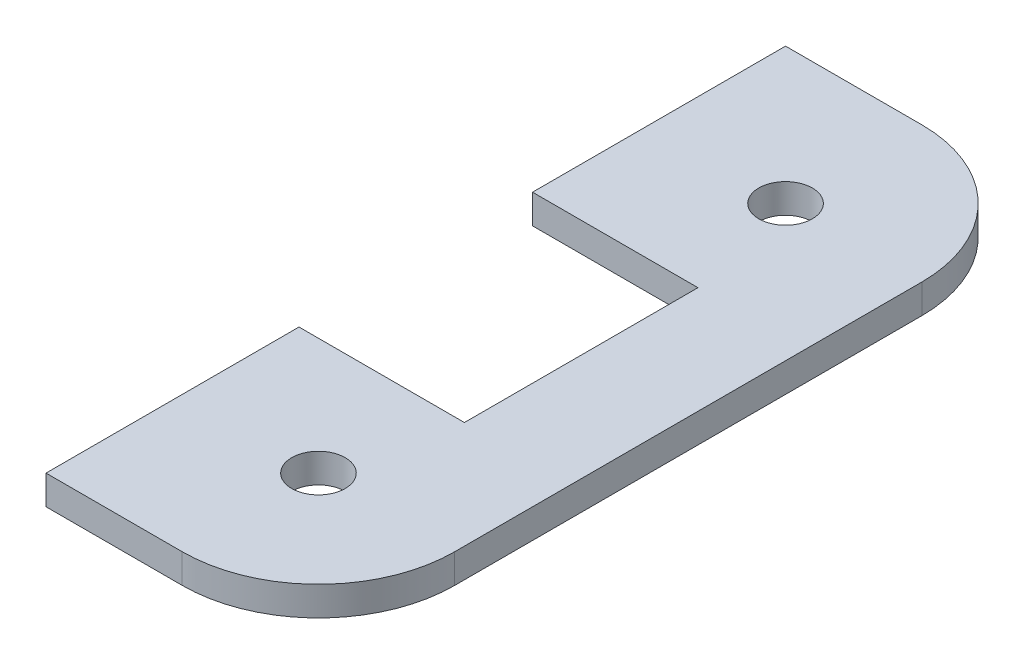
from build123d import *

# Parameters (mm, degrees)
SKETCH1_R      = 2.75
EXTRUDE1_DEPTH = 3


with BuildPart() as part:
    # Sketch1 → Extrude1 (new body)
    with BuildSketch(Plane(origin=(0, 0, 0), x_dir=(1, 0, 0), z_dir=(0, 1, 0))):
        with BuildLine():
            Line((0, 0), (0, 26))
            Line((0, 26), (17, 26))
            Line((17, 26), (17, 50))
            Line((17, 50), (0, 50))
            Line((0, 50), (0, 76))
            Line((0, 76), (14, 76))
            ThreePointArc((14, 76), (23.899494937, 71.899494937), (28, 62))
            Line((28, 62), (28, 14))
            ThreePointArc((28, 14), (23.899494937, 4.100505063), (14, 0))
            Line((14, 0), (0, 0))
        make_face()
        with Locations(Location((14, 14, 0), (0, 0, 90))):
            Circle(SKETCH1_R, mode=Mode.SUBTRACT)
        with Locations(Location((14, 62, 0), (0, 0, 90))):
            Circle(SKETCH1_R, mode=Mode.SUBTRACT)
    extrude(amount=EXTRUDE1_DEPTH)


solid = part.part
